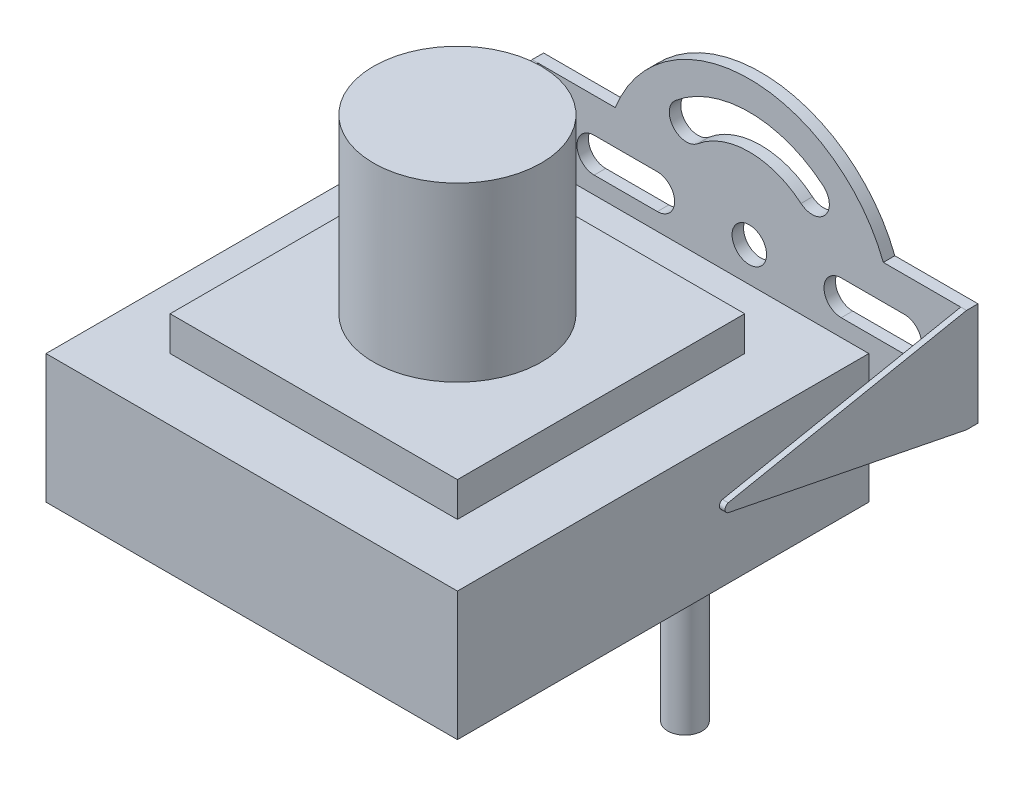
ISO-10303-21;
HEADER;
FILE_DESCRIPTION(('STEP AP214'),'2;1');
FILE_NAME('part.step','',(''),(''),'','','');
FILE_SCHEMA(('AUTOMOTIVE_DESIGN { 1 0 10303 214 1 1 1 1 }'));
ENDSEC;
DATA;
#1=APPLICATION_CONTEXT('core data for automotive mechanical design processes');
#2=APPLICATION_PROTOCOL_DEFINITION('international standard','automotive_design',2000,#1);
#3=PRODUCT_CONTEXT('',#1,'mechanical');
#4=PRODUCT('Part','Part','',(#3));
#5=PRODUCT_RELATED_PRODUCT_CATEGORY('part','',(#4));
#6=PRODUCT_DEFINITION_FORMATION('','',#4);
#7=PRODUCT_DEFINITION_CONTEXT('part definition',#1,'design');
#8=PRODUCT_DEFINITION('design','',#6,#7);
#9=PRODUCT_DEFINITION_SHAPE('','',#8);
#10=(LENGTH_UNIT() NAMED_UNIT(*) SI_UNIT(.MILLI.,.METRE.));
#11=(NAMED_UNIT(*) PLANE_ANGLE_UNIT() SI_UNIT($,.RADIAN.));
#12=(NAMED_UNIT(*) SI_UNIT($,.STERADIAN.) SOLID_ANGLE_UNIT());
#13=UNCERTAINTY_MEASURE_WITH_UNIT(LENGTH_MEASURE(1.E-05),#10,'distance_accuracy_value','');
#14=(GEOMETRIC_REPRESENTATION_CONTEXT(3) GLOBAL_UNCERTAINTY_ASSIGNED_CONTEXT((#13)) GLOBAL_UNIT_ASSIGNED_CONTEXT((#10,
#11,#12)) REPRESENTATION_CONTEXT('',''));
#15=CARTESIAN_POINT('',(0.,0.,0.));
#16=DIRECTION('',(0.,0.,1.));
#17=DIRECTION('',(1.,0.,0.));
#18=AXIS2_PLACEMENT_3D('',#15,#16,#17);
#19=CARTESIAN_POINT('',(0.,6.7,-26.4));
#20=DIRECTION('',(0.,0.,-1.));
#21=DIRECTION('',(-1.,0.,0.));
#22=AXIS2_PLACEMENT_3D('',#19,#20,#21);
#23=PLANE('',#22);
#24=DIRECTION('',(-1.,0.,0.));
#25=VECTOR('',#24,1.);
#26=CARTESIAN_POINT('',(-18.4,2.2,-26.4));
#27=LINE('',#26,#25);
#28=CARTESIAN_POINT('',(-11.6619037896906,2.2,-26.4));
#29=VERTEX_POINT('',#28);
#30=CARTESIAN_POINT('',(-18.9,2.2,-26.4));
#31=VERTEX_POINT('',#30);
#32=EDGE_CURVE('E467',#29,#31,#27,.T.);
#33=ORIENTED_EDGE('',*,*,#32,.T.);
#34=DIRECTION('',(0.,-1.,0.));
#35=VECTOR('',#34,1.);
#36=CARTESIAN_POINT('',(-18.9,11.2,-26.4));
#37=LINE('',#36,#35);
#38=CARTESIAN_POINT('',(-18.9,11.2,-26.4));
#39=VERTEX_POINT('',#38);
#40=EDGE_CURVE('E302',#39,#31,#37,.T.);
#41=ORIENTED_EDGE('',*,*,#40,.F.);
#42=DIRECTION('',(1.,0.,0.));
#43=VECTOR('',#42,1.);
#44=CARTESIAN_POINT('',(-18.4,11.2,-26.4));
#45=LINE('',#44,#43);
#46=CARTESIAN_POINT('',(-11.6619037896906,11.2,-26.4));
#47=VERTEX_POINT('',#46);
#48=EDGE_CURVE('E456',#39,#47,#45,.T.);
#49=ORIENTED_EDGE('',*,*,#48,.T.);
#50=CARTESIAN_POINT('',(0.,6.7,-26.4));
#51=DIRECTION('',(0.,0.,-1.));
#52=DIRECTION('',(-1.,0.,0.));
#53=AXIS2_PLACEMENT_3D('',#50,#51,#52);
#54=CIRCLE('',#53,12.5);
#55=CARTESIAN_POINT('',(11.6619037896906,11.2,-26.4));
#56=VERTEX_POINT('',#55);
#57=EDGE_CURVE('E458',#47,#56,#54,.T.);
#58=ORIENTED_EDGE('',*,*,#57,.T.);
#59=DIRECTION('',(1.,0.,0.));
#60=VECTOR('',#59,1.);
#61=CARTESIAN_POINT('',(18.4,11.2,-26.4));
#62=LINE('',#61,#60);
#63=CARTESIAN_POINT('',(18.9,11.2,-26.4));
#64=VERTEX_POINT('',#63);
#65=EDGE_CURVE('E461',#56,#64,#62,.T.);
#66=ORIENTED_EDGE('',*,*,#65,.T.);
#67=DIRECTION('',(0.,-1.,0.));
#68=VECTOR('',#67,1.);
#69=CARTESIAN_POINT('',(18.9,11.2,-26.4));
#70=LINE('',#69,#68);
#71=CARTESIAN_POINT('',(18.9,2.2,-26.4));
#72=VERTEX_POINT('',#71);
#73=EDGE_CURVE('E271',#64,#72,#70,.T.);
#74=ORIENTED_EDGE('',*,*,#73,.T.);
#75=DIRECTION('',(-1.,0.,0.));
#76=VECTOR('',#75,1.);
#77=CARTESIAN_POINT('',(18.4,2.20000000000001,-26.4));
#78=LINE('',#77,#76);
#79=CARTESIAN_POINT('',(11.6619037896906,2.2,-26.4));
#80=VERTEX_POINT('',#79);
#81=EDGE_CURVE('E463',#72,#80,#78,.T.);
#82=ORIENTED_EDGE('',*,*,#81,.T.);
#83=CARTESIAN_POINT('',(0.,6.7,-26.4));
#84=DIRECTION('',(0.,0.,-1.));
#85=DIRECTION('',(-1.,0.,0.));
#86=AXIS2_PLACEMENT_3D('',#83,#84,#85);
#87=CIRCLE('',#86,12.5);
#88=EDGE_CURVE('E465',#80,#29,#87,.T.);
#89=ORIENTED_EDGE('',*,*,#88,.T.);
#90=EDGE_LOOP('',(#33,#41,#49,#58,#66,#74,#82,#89));
#91=FACE_BOUND('',#90,.T.);
#92=CARTESIAN_POINT('',(0.,6.7,-26.4));
#93=DIRECTION('',(0.,0.,-1.));
#94=DIRECTION('',(-1.,0.,0.));
#95=AXIS2_PLACEMENT_3D('',#92,#93,#94);
#96=CIRCLE('',#95,1.5);
#97=CARTESIAN_POINT('',(-1.5,6.7,-26.4));
#98=VERTEX_POINT('',#97);
#99=EDGE_CURVE('E450',#98,#98,#96,.T.);
#100=ORIENTED_EDGE('',*,*,#99,.F.);
#101=EDGE_LOOP('',(#100));
#102=FACE_BOUND('',#101,.T.);
#103=CARTESIAN_POINT('',(0.,6.7,-26.4));
#104=DIRECTION('',(0.,0.,-1.));
#105=DIRECTION('',(-1.,0.,0.));
#106=AXIS2_PLACEMENT_3D('',#103,#104,#105);
#107=CIRCLE('',#106,10.);
#108=CARTESIAN_POINT('',(-6.42787609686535,14.3604444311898,-26.4));
#109=VERTEX_POINT('',#108);
#110=CARTESIAN_POINT('',(6.42787609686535,14.3604444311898,-26.4));
#111=VERTEX_POINT('',#110);
#112=EDGE_CURVE('E421',#109,#111,#107,.T.);
#113=ORIENTED_EDGE('',*,*,#112,.F.);
#114=CARTESIAN_POINT('',(-5.46369468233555,13.2113777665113,-26.4));
#115=DIRECTION('',(0.,0.,-1.));
#116=DIRECTION('',(-1.,0.,0.));
#117=AXIS2_PLACEMENT_3D('',#114,#115,#116);
#118=CIRCLE('',#117,1.5);
#119=CARTESIAN_POINT('',(-4.49951326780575,12.0623111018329,-26.4));
#120=VERTEX_POINT('',#119);
#121=EDGE_CURVE('E419',#120,#109,#118,.T.);
#122=ORIENTED_EDGE('',*,*,#121,.F.);
#123=CARTESIAN_POINT('',(0.,6.7,-26.4));
#124=DIRECTION('',(0.,0.,1.));
#125=DIRECTION('',(-1.,0.,0.));
#126=AXIS2_PLACEMENT_3D('',#123,#124,#125);
#127=CIRCLE('',#126,7.);
#128=CARTESIAN_POINT('',(4.49951326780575,12.0623111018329,-26.4));
#129=VERTEX_POINT('',#128);
#130=EDGE_CURVE('E427',#129,#120,#127,.T.);
#131=ORIENTED_EDGE('',*,*,#130,.F.);
#132=CARTESIAN_POINT('',(5.46369468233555,13.2113777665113,-26.4));
#133=DIRECTION('',(0.,0.,-1.));
#134=DIRECTION('',(-1.,0.,0.));
#135=AXIS2_PLACEMENT_3D('',#132,#133,#134);
#136=CIRCLE('',#135,1.5);
#137=EDGE_CURVE('E424',#111,#129,#136,.T.);
#138=ORIENTED_EDGE('',*,*,#137,.F.);
#139=EDGE_LOOP('',(#113,#122,#131,#138));
#140=FACE_BOUND('',#139,.T.);
#141=CARTESIAN_POINT('',(0.,6.7,-26.4));
#142=DIRECTION('',(0.,0.,1.));
#143=DIRECTION('',(1.,0.,0.));
#144=AXIS2_PLACEMENT_3D('',#141,#142,#143);
#145=CIRCLE('',#144,7.00000000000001);
#146=CARTESIAN_POINT('',(-4.49951326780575,1.33768889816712,-26.4));
#147=VERTEX_POINT('',#146);
#148=CARTESIAN_POINT('',(4.49951326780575,1.33768889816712,-26.4));
#149=VERTEX_POINT('',#148);
#150=EDGE_CURVE('E390',#147,#149,#145,.T.);
#151=ORIENTED_EDGE('',*,*,#150,.F.);
#152=CARTESIAN_POINT('',(-5.46369468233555,0.188622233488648,-26.4));
#153=DIRECTION('',(0.,0.,-1.));
#154=DIRECTION('',(1.,0.,0.));
#155=AXIS2_PLACEMENT_3D('',#152,#153,#154);
#156=CIRCLE('',#155,1.5);
#157=CARTESIAN_POINT('',(-6.42787609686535,-0.960444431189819,-26.4));
#158=VERTEX_POINT('',#157);
#159=EDGE_CURVE('E388',#158,#147,#156,.T.);
#160=ORIENTED_EDGE('',*,*,#159,.F.);
#161=CARTESIAN_POINT('',(0.,6.7,-26.4));
#162=DIRECTION('',(0.,0.,-1.));
#163=DIRECTION('',(1.,0.,0.));
#164=AXIS2_PLACEMENT_3D('',#161,#162,#163);
#165=CIRCLE('',#164,10.);
#166=CARTESIAN_POINT('',(6.42787609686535,-0.960444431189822,-26.4));
#167=VERTEX_POINT('',#166);
#168=EDGE_CURVE('E396',#167,#158,#165,.T.);
#169=ORIENTED_EDGE('',*,*,#168,.F.);
#170=CARTESIAN_POINT('',(5.46369468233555,0.18862223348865,-26.4));
#171=DIRECTION('',(0.,0.,-1.));
#172=DIRECTION('',(1.,0.,0.));
#173=AXIS2_PLACEMENT_3D('',#170,#171,#172);
#174=CIRCLE('',#173,1.5);
#175=EDGE_CURVE('E393',#149,#167,#174,.T.);
#176=ORIENTED_EDGE('',*,*,#175,.F.);
#177=EDGE_LOOP('',(#151,#160,#169,#176));
#178=FACE_BOUND('',#177,.T.);
#179=DIRECTION('',(-1.,0.,0.));
#180=VECTOR('',#179,1.);
#181=CARTESIAN_POINT('',(-8.,5.20000000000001,-26.4));
#182=LINE('',#181,#180);
#183=CARTESIAN_POINT('',(-8.,5.20000000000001,-26.4));
#184=VERTEX_POINT('',#183);
#185=CARTESIAN_POINT('',(-13.5,5.20000000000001,-26.4));
#186=VERTEX_POINT('',#185);
#187=EDGE_CURVE('E359',#184,#186,#182,.T.);
#188=ORIENTED_EDGE('',*,*,#187,.F.);
#189=CARTESIAN_POINT('',(-8.,6.70000000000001,-26.4));
#190=DIRECTION('',(0.,0.,-1.));
#191=DIRECTION('',(-1.,0.,0.));
#192=AXIS2_PLACEMENT_3D('',#189,#190,#191);
#193=CIRCLE('',#192,1.5);
#194=CARTESIAN_POINT('',(-8.,8.2,-26.4));
#195=VERTEX_POINT('',#194);
#196=EDGE_CURVE('E357',#195,#184,#193,.T.);
#197=ORIENTED_EDGE('',*,*,#196,.F.);
#198=DIRECTION('',(1.,0.,0.));
#199=VECTOR('',#198,1.);
#200=CARTESIAN_POINT('',(-8.,8.2,-26.4));
#201=LINE('',#200,#199);
#202=CARTESIAN_POINT('',(-13.5,8.2,-26.4));
#203=VERTEX_POINT('',#202);
#204=EDGE_CURVE('E365',#203,#195,#201,.T.);
#205=ORIENTED_EDGE('',*,*,#204,.F.);
#206=CARTESIAN_POINT('',(-13.5,6.70000000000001,-26.4));
#207=DIRECTION('',(0.,0.,-1.));
#208=DIRECTION('',(-1.,0.,0.));
#209=AXIS2_PLACEMENT_3D('',#206,#207,#208);
#210=CIRCLE('',#209,1.5);
#211=EDGE_CURVE('E362',#186,#203,#210,.T.);
#212=ORIENTED_EDGE('',*,*,#211,.F.);
#213=EDGE_LOOP('',(#188,#197,#205,#212));
#214=FACE_BOUND('',#213,.T.);
#215=DIRECTION('',(1.,0.,0.));
#216=VECTOR('',#215,1.);
#217=CARTESIAN_POINT('',(8.,8.2,-26.4));
#218=LINE('',#217,#216);
#219=CARTESIAN_POINT('',(8.,8.2,-26.4));
#220=VERTEX_POINT('',#219);
#221=CARTESIAN_POINT('',(13.5,8.2,-26.4));
#222=VERTEX_POINT('',#221);
#223=EDGE_CURVE('E333',#220,#222,#218,.T.);
#224=ORIENTED_EDGE('',*,*,#223,.F.);
#225=CARTESIAN_POINT('',(8.,6.7,-26.4));
#226=DIRECTION('',(0.,0.,-1.));
#227=DIRECTION('',(1.,0.,0.));
#228=AXIS2_PLACEMENT_3D('',#225,#226,#227);
#229=CIRCLE('',#228,1.5);
#230=CARTESIAN_POINT('',(8.,5.20000000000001,-26.4));
#231=VERTEX_POINT('',#230);
#232=EDGE_CURVE('E331',#231,#220,#229,.T.);
#233=ORIENTED_EDGE('',*,*,#232,.F.);
#234=DIRECTION('',(-1.,0.,0.));
#235=VECTOR('',#234,1.);
#236=CARTESIAN_POINT('',(8.,5.20000000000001,-26.4));
#237=LINE('',#236,#235);
#238=CARTESIAN_POINT('',(13.5,5.20000000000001,-26.4));
#239=VERTEX_POINT('',#238);
#240=EDGE_CURVE('E338',#239,#231,#237,.T.);
#241=ORIENTED_EDGE('',*,*,#240,.F.);
#242=CARTESIAN_POINT('',(13.5,6.70000000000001,-26.4));
#243=DIRECTION('',(0.,0.,-1.));
#244=DIRECTION('',(1.,0.,0.));
#245=AXIS2_PLACEMENT_3D('',#242,#243,#244);
#246=CIRCLE('',#245,1.5);
#247=EDGE_CURVE('E336',#222,#239,#246,.T.);
#248=ORIENTED_EDGE('',*,*,#247,.F.);
#249=EDGE_LOOP('',(#224,#233,#241,#248));
#250=FACE_BOUND('',#249,.T.);
#251=ADVANCED_FACE('F47',(#91,#102,#140,#178,#214,#250),#23,.T.);
#252=CARTESIAN_POINT('',(0.,6.7,-25.4));
#253=DIRECTION('',(0.,0.,-1.));
#254=DIRECTION('',(-1.,0.,0.));
#255=AXIS2_PLACEMENT_3D('',#252,#253,#254);
#256=PLANE('',#255);
#257=CARTESIAN_POINT('',(-8.,6.70000000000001,-25.4));
#258=DIRECTION('',(0.,0.,-1.));
#259=DIRECTION('',(-1.,0.,0.));
#260=AXIS2_PLACEMENT_3D('',#257,#258,#259);
#261=CIRCLE('',#260,1.5);
#262=CARTESIAN_POINT('',(-8.,8.2,-25.4));
#263=VERTEX_POINT('',#262);
#264=CARTESIAN_POINT('',(-8.,5.20000000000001,-25.4));
#265=VERTEX_POINT('',#264);
#266=EDGE_CURVE('E356',#263,#265,#261,.T.);
#267=ORIENTED_EDGE('',*,*,#266,.T.);
#268=DIRECTION('',(-1.,0.,0.));
#269=VECTOR('',#268,1.);
#270=CARTESIAN_POINT('',(-8.,5.20000000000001,-25.4));
#271=LINE('',#270,#269);
#272=CARTESIAN_POINT('',(-13.5,5.20000000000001,-25.4));
#273=VERTEX_POINT('',#272);
#274=EDGE_CURVE('E370',#265,#273,#271,.T.);
#275=ORIENTED_EDGE('',*,*,#274,.T.);
#276=CARTESIAN_POINT('',(-13.5,6.70000000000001,-25.4));
#277=DIRECTION('',(0.,0.,-1.));
#278=DIRECTION('',(-1.,0.,0.));
#279=AXIS2_PLACEMENT_3D('',#276,#277,#278);
#280=CIRCLE('',#279,1.5);
#281=CARTESIAN_POINT('',(-13.5,8.2,-25.4));
#282=VERTEX_POINT('',#281);
#283=EDGE_CURVE('E373',#273,#282,#280,.T.);
#284=ORIENTED_EDGE('',*,*,#283,.T.);
#285=DIRECTION('',(1.,0.,0.));
#286=VECTOR('',#285,1.);
#287=CARTESIAN_POINT('',(-8.,8.2,-25.4));
#288=LINE('',#287,#286);
#289=EDGE_CURVE('E360',#282,#263,#288,.T.);
#290=ORIENTED_EDGE('',*,*,#289,.T.);
#291=EDGE_LOOP('',(#267,#275,#284,#290));
#292=FACE_BOUND('',#291,.T.);
#293=CARTESIAN_POINT('',(-5.46369468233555,13.2113777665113,-25.4));
#294=DIRECTION('',(0.,0.,-1.));
#295=DIRECTION('',(-1.,0.,0.));
#296=AXIS2_PLACEMENT_3D('',#293,#294,#295);
#297=CIRCLE('',#296,1.5);
#298=CARTESIAN_POINT('',(-4.49951326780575,12.0623111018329,-25.4));
#299=VERTEX_POINT('',#298);
#300=CARTESIAN_POINT('',(-6.42787609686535,14.3604444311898,-25.4));
#301=VERTEX_POINT('',#300);
#302=EDGE_CURVE('E418',#299,#301,#297,.T.);
#303=ORIENTED_EDGE('',*,*,#302,.T.);
#304=CARTESIAN_POINT('',(0.,6.7,-25.4));
#305=DIRECTION('',(0.,0.,-1.));
#306=DIRECTION('',(-1.,0.,0.));
#307=AXIS2_PLACEMENT_3D('',#304,#305,#306);
#308=CIRCLE('',#307,10.);
#309=CARTESIAN_POINT('',(6.42787609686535,14.3604444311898,-25.4));
#310=VERTEX_POINT('',#309);
#311=EDGE_CURVE('E432',#301,#310,#308,.T.);
#312=ORIENTED_EDGE('',*,*,#311,.T.);
#313=CARTESIAN_POINT('',(5.46369468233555,13.2113777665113,-25.4));
#314=DIRECTION('',(0.,0.,-1.));
#315=DIRECTION('',(-1.,0.,0.));
#316=AXIS2_PLACEMENT_3D('',#313,#314,#315);
#317=CIRCLE('',#316,1.5);
#318=CARTESIAN_POINT('',(4.49951326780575,12.0623111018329,-25.4));
#319=VERTEX_POINT('',#318);
#320=EDGE_CURVE('E435',#310,#319,#317,.T.);
#321=ORIENTED_EDGE('',*,*,#320,.T.);
#322=CARTESIAN_POINT('',(0.,6.7,-25.4));
#323=DIRECTION('',(0.,0.,1.));
#324=DIRECTION('',(-1.,0.,0.));
#325=AXIS2_PLACEMENT_3D('',#322,#323,#324);
#326=CIRCLE('',#325,7.);
#327=EDGE_CURVE('E422',#319,#299,#326,.T.);
#328=ORIENTED_EDGE('',*,*,#327,.T.);
#329=EDGE_LOOP('',(#303,#312,#321,#328));
#330=FACE_BOUND('',#329,.T.);
#331=DIRECTION('',(0.,1.,0.));
#332=VECTOR('',#331,1.);
#333=CARTESIAN_POINT('',(-18.4,11.2,-25.4));
#334=LINE('',#333,#332);
#335=CARTESIAN_POINT('',(-18.4,2.2,-25.4));
#336=VERTEX_POINT('',#335);
#337=CARTESIAN_POINT('',(-18.4,11.2,-25.4));
#338=VERTEX_POINT('',#337);
#339=EDGE_CURVE('E453',#336,#338,#334,.T.);
#340=ORIENTED_EDGE('',*,*,#339,.F.);
#341=DIRECTION('',(-1.,0.,0.));
#342=VECTOR('',#341,1.);
#343=CARTESIAN_POINT('',(-18.4,2.2,-25.4));
#344=LINE('',#343,#342);
#345=CARTESIAN_POINT('',(-11.6619037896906,2.2,-25.4));
#346=VERTEX_POINT('',#345);
#347=EDGE_CURVE('E459',#346,#336,#344,.T.);
#348=ORIENTED_EDGE('',*,*,#347,.F.);
#349=CARTESIAN_POINT('',(0.,6.7,-25.4));
#350=DIRECTION('',(0.,0.,-1.));
#351=DIRECTION('',(-1.,0.,0.));
#352=AXIS2_PLACEMENT_3D('',#349,#350,#351);
#353=CIRCLE('',#352,12.5);
#354=CARTESIAN_POINT('',(11.6619037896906,2.2,-25.4));
#355=VERTEX_POINT('',#354);
#356=EDGE_CURVE('E482',#355,#346,#353,.T.);
#357=ORIENTED_EDGE('',*,*,#356,.F.);
#358=DIRECTION('',(-1.,0.,0.));
#359=VECTOR('',#358,1.);
#360=CARTESIAN_POINT('',(18.4,2.20000000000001,-25.4));
#361=LINE('',#360,#359);
#362=CARTESIAN_POINT('',(18.4,2.2,-25.4));
#363=VERTEX_POINT('',#362);
#364=EDGE_CURVE('E480',#363,#355,#361,.T.);
#365=ORIENTED_EDGE('',*,*,#364,.F.);
#366=DIRECTION('',(0.,-1.,0.));
#367=VECTOR('',#366,1.);
#368=CARTESIAN_POINT('',(18.4,11.2,-25.4));
#369=LINE('',#368,#367);
#370=CARTESIAN_POINT('',(18.4,11.2,-25.4));
#371=VERTEX_POINT('',#370);
#372=EDGE_CURVE('E477',#371,#363,#369,.T.);
#373=ORIENTED_EDGE('',*,*,#372,.F.);
#374=DIRECTION('',(1.,0.,0.));
#375=VECTOR('',#374,1.);
#376=CARTESIAN_POINT('',(18.4,11.2,-25.4));
#377=LINE('',#376,#375);
#378=CARTESIAN_POINT('',(11.6619037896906,11.2,-25.4));
#379=VERTEX_POINT('',#378);
#380=EDGE_CURVE('E254',#379,#371,#377,.T.);
#381=ORIENTED_EDGE('',*,*,#380,.F.);
#382=CARTESIAN_POINT('',(0.,6.7,-25.4));
#383=DIRECTION('',(0.,0.,-1.));
#384=DIRECTION('',(-1.,0.,0.));
#385=AXIS2_PLACEMENT_3D('',#382,#383,#384);
#386=CIRCLE('',#385,12.5);
#387=CARTESIAN_POINT('',(-11.6619037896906,11.2,-25.4));
#388=VERTEX_POINT('',#387);
#389=EDGE_CURVE('E474',#388,#379,#386,.T.);
#390=ORIENTED_EDGE('',*,*,#389,.F.);
#391=DIRECTION('',(1.,0.,0.));
#392=VECTOR('',#391,1.);
#393=CARTESIAN_POINT('',(-18.4,11.2,-25.4));
#394=LINE('',#393,#392);
#395=EDGE_CURVE('E472',#338,#388,#394,.T.);
#396=ORIENTED_EDGE('',*,*,#395,.F.);
#397=EDGE_LOOP('',(#340,#348,#357,#365,#373,#381,#390,#396));
#398=FACE_BOUND('',#397,.T.);
#399=CARTESIAN_POINT('',(0.,6.7,-25.4));
#400=DIRECTION('',(0.,0.,-1.));
#401=DIRECTION('',(-1.,0.,0.));
#402=AXIS2_PLACEMENT_3D('',#399,#400,#401);
#403=CIRCLE('',#402,1.5);
#404=CARTESIAN_POINT('',(-1.5,6.7,-25.4));
#405=VERTEX_POINT('',#404);
#406=EDGE_CURVE('E449',#405,#405,#403,.T.);
#407=ORIENTED_EDGE('',*,*,#406,.T.);
#408=EDGE_LOOP('',(#407));
#409=FACE_BOUND('',#408,.T.);
#410=CARTESIAN_POINT('',(-5.46369468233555,0.188622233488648,-25.4));
#411=DIRECTION('',(0.,0.,-1.));
#412=DIRECTION('',(1.,0.,0.));
#413=AXIS2_PLACEMENT_3D('',#410,#411,#412);
#414=CIRCLE('',#413,1.5);
#415=CARTESIAN_POINT('',(-6.42787609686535,-0.960444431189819,-25.4));
#416=VERTEX_POINT('',#415);
#417=CARTESIAN_POINT('',(-4.49951326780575,1.33768889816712,-25.4));
#418=VERTEX_POINT('',#417);
#419=EDGE_CURVE('E387',#416,#418,#414,.T.);
#420=ORIENTED_EDGE('',*,*,#419,.T.);
#421=CARTESIAN_POINT('',(0.,6.7,-25.4));
#422=DIRECTION('',(0.,0.,1.));
#423=DIRECTION('',(1.,0.,0.));
#424=AXIS2_PLACEMENT_3D('',#421,#422,#423);
#425=CIRCLE('',#424,7.00000000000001);
#426=CARTESIAN_POINT('',(4.49951326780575,1.33768889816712,-25.4));
#427=VERTEX_POINT('',#426);
#428=EDGE_CURVE('E401',#418,#427,#425,.T.);
#429=ORIENTED_EDGE('',*,*,#428,.T.);
#430=CARTESIAN_POINT('',(5.46369468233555,0.18862223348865,-25.4));
#431=DIRECTION('',(0.,0.,-1.));
#432=DIRECTION('',(1.,0.,0.));
#433=AXIS2_PLACEMENT_3D('',#430,#431,#432);
#434=CIRCLE('',#433,1.5);
#435=CARTESIAN_POINT('',(6.42787609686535,-0.960444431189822,-25.4));
#436=VERTEX_POINT('',#435);
#437=EDGE_CURVE('E404',#427,#436,#434,.T.);
#438=ORIENTED_EDGE('',*,*,#437,.T.);
#439=CARTESIAN_POINT('',(0.,6.7,-25.4));
#440=DIRECTION('',(0.,0.,-1.));
#441=DIRECTION('',(1.,0.,0.));
#442=AXIS2_PLACEMENT_3D('',#439,#440,#441);
#443=CIRCLE('',#442,10.);
#444=EDGE_CURVE('E391',#436,#416,#443,.T.);
#445=ORIENTED_EDGE('',*,*,#444,.T.);
#446=EDGE_LOOP('',(#420,#429,#438,#445));
#447=FACE_BOUND('',#446,.T.);
#448=CARTESIAN_POINT('',(8.,6.7,-25.4));
#449=DIRECTION('',(0.,0.,-1.));
#450=DIRECTION('',(1.,0.,0.));
#451=AXIS2_PLACEMENT_3D('',#448,#449,#450);
#452=CIRCLE('',#451,1.5);
#453=CARTESIAN_POINT('',(8.,5.20000000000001,-25.4));
#454=VERTEX_POINT('',#453);
#455=CARTESIAN_POINT('',(8.,8.2,-25.4));
#456=VERTEX_POINT('',#455);
#457=EDGE_CURVE('E70',#454,#456,#452,.T.);
#458=ORIENTED_EDGE('',*,*,#457,.T.);
#459=DIRECTION('',(1.,0.,0.));
#460=VECTOR('',#459,1.);
#461=CARTESIAN_POINT('',(8.,8.2,-25.4));
#462=LINE('',#461,#460);
#463=CARTESIAN_POINT('',(13.5,8.2,-25.4));
#464=VERTEX_POINT('',#463);
#465=EDGE_CURVE('E342',#456,#464,#462,.T.);
#466=ORIENTED_EDGE('',*,*,#465,.T.);
#467=CARTESIAN_POINT('',(13.5,6.70000000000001,-25.4));
#468=DIRECTION('',(0.,0.,-1.));
#469=DIRECTION('',(1.,0.,0.));
#470=AXIS2_PLACEMENT_3D('',#467,#468,#469);
#471=CIRCLE('',#470,1.5);
#472=CARTESIAN_POINT('',(13.5,5.20000000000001,-25.4));
#473=VERTEX_POINT('',#472);
#474=EDGE_CURVE('E345',#464,#473,#471,.T.);
#475=ORIENTED_EDGE('',*,*,#474,.T.);
#476=DIRECTION('',(-1.,0.,0.));
#477=VECTOR('',#476,1.);
#478=CARTESIAN_POINT('',(8.,5.20000000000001,-25.4));
#479=LINE('',#478,#477);
#480=EDGE_CURVE('E334',#473,#454,#479,.T.);
#481=ORIENTED_EDGE('',*,*,#480,.T.);
#482=EDGE_LOOP('',(#458,#466,#475,#481));
#483=FACE_BOUND('',#482,.T.);
#484=ADVANCED_FACE('F495',(#292,#330,#398,#409,#447,#483),#256,.F.);
#485=CARTESIAN_POINT('',(-18.4,11.2,-26.4));
#486=DIRECTION('',(0.,-1.,0.));
#487=DIRECTION('',(0.,0.,-1.));
#488=AXIS2_PLACEMENT_3D('',#485,#486,#487);
#489=PLANE('',#488);
#490=ORIENTED_EDGE('',*,*,#395,.T.);
#491=DIRECTION('',(0.,0.,1.));
#492=VECTOR('',#491,1.);
#493=CARTESIAN_POINT('',(-11.6619037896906,11.2,-26.4));
#494=LINE('',#493,#492);
#495=EDGE_CURVE('E12',#47,#388,#494,.T.);
#496=ORIENTED_EDGE('',*,*,#495,.F.);
#497=ORIENTED_EDGE('',*,*,#48,.F.);
#498=DIRECTION('',(0.,0.,-1.));
#499=VECTOR('',#498,1.);
#500=CARTESIAN_POINT('',(-18.9,11.2,-25.4));
#501=LINE('',#500,#499);
#502=CARTESIAN_POINT('',(-18.9,11.2,-25.4));
#503=VERTEX_POINT('',#502);
#504=EDGE_CURVE('E299',#503,#39,#501,.T.);
#505=ORIENTED_EDGE('',*,*,#504,.F.);
#506=DIRECTION('',(1.,0.,0.));
#507=VECTOR('',#506,1.);
#508=CARTESIAN_POINT('',(-18.9,11.2,-25.4));
#509=LINE('',#508,#507);
#510=EDGE_CURVE('E314',#503,#338,#509,.T.);
#511=ORIENTED_EDGE('',*,*,#510,.T.);
#512=EDGE_LOOP('',(#490,#496,#497,#505,#511));
#513=FACE_BOUND('',#512,.T.);
#514=ADVANCED_FACE('F49',(#513),#489,.F.);
#515=CARTESIAN_POINT('',(0.,6.7,-26.4));
#516=DIRECTION('',(0.,0.,1.));
#517=DIRECTION('',(1.,0.,0.));
#518=AXIS2_PLACEMENT_3D('',#515,#516,#517);
#519=CYLINDRICAL_SURFACE('',#518,12.5);
#520=ORIENTED_EDGE('',*,*,#389,.T.);
#521=DIRECTION('',(0.,0.,1.));
#522=VECTOR('',#521,1.);
#523=CARTESIAN_POINT('',(11.6619037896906,11.2,-26.4));
#524=LINE('',#523,#522);
#525=EDGE_CURVE('E55',#56,#379,#524,.T.);
#526=ORIENTED_EDGE('',*,*,#525,.F.);
#527=ORIENTED_EDGE('',*,*,#57,.F.);
#528=ORIENTED_EDGE('',*,*,#495,.T.);
#529=EDGE_LOOP('',(#520,#526,#527,#528));
#530=FACE_BOUND('',#529,.T.);
#531=ADVANCED_FACE('F514',(#530),#519,.T.);
#532=CARTESIAN_POINT('',(18.4,11.2,-26.4));
#533=DIRECTION('',(0.,-1.,0.));
#534=DIRECTION('',(1.,0.,0.));
#535=AXIS2_PLACEMENT_3D('',#532,#533,#534);
#536=PLANE('',#535);
#537=ORIENTED_EDGE('',*,*,#380,.T.);
#538=DIRECTION('',(-1.,0.,0.));
#539=VECTOR('',#538,1.);
#540=CARTESIAN_POINT('',(18.9,11.2,-25.4));
#541=LINE('',#540,#539);
#542=CARTESIAN_POINT('',(18.9,11.2,-25.4));
#543=VERTEX_POINT('',#542);
#544=EDGE_CURVE('E246',#543,#371,#541,.T.);
#545=ORIENTED_EDGE('',*,*,#544,.F.);
#546=DIRECTION('',(0.,0.,-1.));
#547=VECTOR('',#546,1.);
#548=CARTESIAN_POINT('',(18.9,11.2,-25.4));
#549=LINE('',#548,#547);
#550=EDGE_CURVE('E250',#543,#64,#549,.T.);
#551=ORIENTED_EDGE('',*,*,#550,.T.);
#552=ORIENTED_EDGE('',*,*,#65,.F.);
#553=ORIENTED_EDGE('',*,*,#525,.T.);
#554=EDGE_LOOP('',(#537,#545,#551,#552,#553));
#555=FACE_BOUND('',#554,.T.);
#556=ADVANCED_FACE('F248',(#555),#536,.F.);
#557=CARTESIAN_POINT('',(18.4,2.20000000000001,-26.4));
#558=DIRECTION('',(0.,1.,0.));
#559=DIRECTION('',(-1.,0.,0.));
#560=AXIS2_PLACEMENT_3D('',#557,#558,#559);
#561=PLANE('',#560);
#562=ORIENTED_EDGE('',*,*,#364,.T.);
#563=DIRECTION('',(0.,0.,1.));
#564=VECTOR('',#563,1.);
#565=CARTESIAN_POINT('',(11.6619037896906,2.2,-26.4));
#566=LINE('',#565,#564);
#567=EDGE_CURVE('E487',#80,#355,#566,.T.);
#568=ORIENTED_EDGE('',*,*,#567,.F.);
#569=ORIENTED_EDGE('',*,*,#81,.F.);
#570=DIRECTION('',(0.,0.,1.));
#571=VECTOR('',#570,1.);
#572=CARTESIAN_POINT('',(18.9,2.2,-26.4));
#573=LINE('',#572,#571);
#574=CARTESIAN_POINT('',(18.9,2.2,-25.4));
#575=VERTEX_POINT('',#574);
#576=EDGE_CURVE('E282',#72,#575,#573,.T.);
#577=ORIENTED_EDGE('',*,*,#576,.T.);
#578=DIRECTION('',(-1.,0.,0.));
#579=VECTOR('',#578,1.);
#580=CARTESIAN_POINT('',(18.9,2.2,-25.4));
#581=LINE('',#580,#579);
#582=EDGE_CURVE('E286',#575,#363,#581,.T.);
#583=ORIENTED_EDGE('',*,*,#582,.T.);
#584=EDGE_LOOP('',(#562,#568,#569,#577,#583));
#585=FACE_BOUND('',#584,.T.);
#586=ADVANCED_FACE('F502',(#585),#561,.F.);
#587=CARTESIAN_POINT('',(0.,6.7,-26.4));
#588=DIRECTION('',(0.,0.,1.));
#589=DIRECTION('',(1.,0.,0.));
#590=AXIS2_PLACEMENT_3D('',#587,#588,#589);
#591=CYLINDRICAL_SURFACE('',#590,12.5);
#592=ORIENTED_EDGE('',*,*,#356,.T.);
#593=DIRECTION('',(0.,0.,1.));
#594=VECTOR('',#593,1.);
#595=CARTESIAN_POINT('',(-11.6619037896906,2.2,-26.4));
#596=LINE('',#595,#594);
#597=EDGE_CURVE('E469',#29,#346,#596,.T.);
#598=ORIENTED_EDGE('',*,*,#597,.F.);
#599=ORIENTED_EDGE('',*,*,#88,.F.);
#600=ORIENTED_EDGE('',*,*,#567,.T.);
#601=EDGE_LOOP('',(#592,#598,#599,#600));
#602=FACE_BOUND('',#601,.T.);
#603=ADVANCED_FACE('F542',(#602),#591,.T.);
#604=CARTESIAN_POINT('',(-18.4,2.2,-26.4));
#605=DIRECTION('',(0.,1.,0.));
#606=DIRECTION('',(0.,0.,1.));
#607=AXIS2_PLACEMENT_3D('',#604,#605,#606);
#608=PLANE('',#607);
#609=ORIENTED_EDGE('',*,*,#347,.T.);
#610=DIRECTION('',(1.,0.,0.));
#611=VECTOR('',#610,1.);
#612=CARTESIAN_POINT('',(-18.9,2.2,-25.4));
#613=LINE('',#612,#611);
#614=CARTESIAN_POINT('',(-18.9,2.2,-25.4));
#615=VERTEX_POINT('',#614);
#616=EDGE_CURVE('E328',#615,#336,#613,.T.);
#617=ORIENTED_EDGE('',*,*,#616,.F.);
#618=DIRECTION('',(0.,0.,1.));
#619=VECTOR('',#618,1.);
#620=CARTESIAN_POINT('',(-18.9,2.2,-26.4));
#621=LINE('',#620,#619);
#622=EDGE_CURVE('E306',#31,#615,#621,.T.);
#623=ORIENTED_EDGE('',*,*,#622,.F.);
#624=ORIENTED_EDGE('',*,*,#32,.F.);
#625=ORIENTED_EDGE('',*,*,#597,.T.);
#626=EDGE_LOOP('',(#609,#617,#623,#624,#625));
#627=FACE_BOUND('',#626,.T.);
#628=ADVANCED_FACE('F538',(#627),#608,.F.);
#629=CARTESIAN_POINT('',(0.,6.7,-26.4));
#630=DIRECTION('',(0.,0.,1.));
#631=DIRECTION('',(1.,0.,0.));
#632=AXIS2_PLACEMENT_3D('',#629,#630,#631);
#633=CYLINDRICAL_SURFACE('',#632,1.5);
#634=ORIENTED_EDGE('',*,*,#99,.T.);
#635=EDGE_LOOP('',(#634));
#636=FACE_BOUND('',#635,.T.);
#637=ORIENTED_EDGE('',*,*,#406,.F.);
#638=EDGE_LOOP('',(#637));
#639=FACE_BOUND('',#638,.T.);
#640=ADVANCED_FACE('F563',(#636,#639),#633,.F.);
#641=CARTESIAN_POINT('',(-5.46369468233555,13.2113777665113,-26.4));
#642=DIRECTION('',(0.,0.,1.));
#643=DIRECTION('',(1.,0.,0.));
#644=AXIS2_PLACEMENT_3D('',#641,#642,#643);
#645=CYLINDRICAL_SURFACE('',#644,1.5);
#646=ORIENTED_EDGE('',*,*,#302,.F.);
#647=DIRECTION('',(0.,0.,1.));
#648=VECTOR('',#647,1.);
#649=CARTESIAN_POINT('',(-4.49951326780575,12.0623111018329,-26.4));
#650=LINE('',#649,#648);
#651=EDGE_CURVE('E429',#120,#299,#650,.T.);
#652=ORIENTED_EDGE('',*,*,#651,.F.);
#653=ORIENTED_EDGE('',*,*,#121,.T.);
#654=DIRECTION('',(0.,0.,1.));
#655=VECTOR('',#654,1.);
#656=CARTESIAN_POINT('',(-6.42787609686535,14.3604444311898,-26.4));
#657=LINE('',#656,#655);
#658=EDGE_CURVE('E446',#109,#301,#657,.T.);
#659=ORIENTED_EDGE('',*,*,#658,.T.);
#660=EDGE_LOOP('',(#646,#652,#653,#659));
#661=FACE_BOUND('',#660,.T.);
#662=ADVANCED_FACE('F692',(#661),#645,.F.);
#663=CARTESIAN_POINT('',(0.,6.7,-26.4));
#664=DIRECTION('',(0.,0.,1.));
#665=DIRECTION('',(1.,0.,0.));
#666=AXIS2_PLACEMENT_3D('',#663,#664,#665);
#667=CYLINDRICAL_SURFACE('',#666,10.);
#668=ORIENTED_EDGE('',*,*,#311,.F.);
#669=ORIENTED_EDGE('',*,*,#658,.F.);
#670=ORIENTED_EDGE('',*,*,#112,.T.);
#671=DIRECTION('',(0.,0.,1.));
#672=VECTOR('',#671,1.);
#673=CARTESIAN_POINT('',(6.42787609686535,14.3604444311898,-26.4));
#674=LINE('',#673,#672);
#675=EDGE_CURVE('E444',#111,#310,#674,.T.);
#676=ORIENTED_EDGE('',*,*,#675,.T.);
#677=EDGE_LOOP('',(#668,#669,#670,#676));
#678=FACE_BOUND('',#677,.T.);
#679=ADVANCED_FACE('F699',(#678),#667,.F.);
#680=CARTESIAN_POINT('',(5.46369468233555,13.2113777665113,-26.4));
#681=DIRECTION('',(0.,0.,1.));
#682=DIRECTION('',(1.,0.,0.));
#683=AXIS2_PLACEMENT_3D('',#680,#681,#682);
#684=CYLINDRICAL_SURFACE('',#683,1.5);
#685=ORIENTED_EDGE('',*,*,#320,.F.);
#686=ORIENTED_EDGE('',*,*,#675,.F.);
#687=ORIENTED_EDGE('',*,*,#137,.T.);
#688=DIRECTION('',(0.,0.,1.));
#689=VECTOR('',#688,1.);
#690=CARTESIAN_POINT('',(4.49951326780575,12.0623111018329,-26.4));
#691=LINE('',#690,#689);
#692=EDGE_CURVE('E442',#129,#319,#691,.T.);
#693=ORIENTED_EDGE('',*,*,#692,.T.);
#694=EDGE_LOOP('',(#685,#686,#687,#693));
#695=FACE_BOUND('',#694,.T.);
#696=ADVANCED_FACE('F706',(#695),#684,.F.);
#697=CARTESIAN_POINT('',(0.,6.7,-26.4));
#698=DIRECTION('',(0.,0.,1.));
#699=DIRECTION('',(1.,0.,0.));
#700=AXIS2_PLACEMENT_3D('',#697,#698,#699);
#701=CYLINDRICAL_SURFACE('',#700,7.);
#702=ORIENTED_EDGE('',*,*,#327,.F.);
#703=ORIENTED_EDGE('',*,*,#692,.F.);
#704=ORIENTED_EDGE('',*,*,#130,.T.);
#705=ORIENTED_EDGE('',*,*,#651,.T.);
#706=EDGE_LOOP('',(#702,#703,#704,#705));
#707=FACE_BOUND('',#706,.T.);
#708=ADVANCED_FACE('F714',(#707),#701,.T.);
#709=CARTESIAN_POINT('',(-5.46369468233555,0.188622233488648,-26.4));
#710=DIRECTION('',(0.,0.,1.));
#711=DIRECTION('',(1.,0.,0.));
#712=AXIS2_PLACEMENT_3D('',#709,#710,#711);
#713=CYLINDRICAL_SURFACE('',#712,1.5);
#714=ORIENTED_EDGE('',*,*,#419,.F.);
#715=DIRECTION('',(0.,0.,1.));
#716=VECTOR('',#715,1.);
#717=CARTESIAN_POINT('',(-6.42787609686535,-0.960444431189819,-26.4));
#718=LINE('',#717,#716);
#719=EDGE_CURVE('E398',#158,#416,#718,.T.);
#720=ORIENTED_EDGE('',*,*,#719,.F.);
#721=ORIENTED_EDGE('',*,*,#159,.T.);
#722=DIRECTION('',(0.,0.,1.));
#723=VECTOR('',#722,1.);
#724=CARTESIAN_POINT('',(-4.49951326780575,1.33768889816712,-26.4));
#725=LINE('',#724,#723);
#726=EDGE_CURVE('E415',#147,#418,#725,.T.);
#727=ORIENTED_EDGE('',*,*,#726,.T.);
#728=EDGE_LOOP('',(#714,#720,#721,#727));
#729=FACE_BOUND('',#728,.T.);
#730=ADVANCED_FACE('F722',(#729),#713,.F.);
#731=CARTESIAN_POINT('',(0.,6.7,-26.4));
#732=DIRECTION('',(0.,0.,1.));
#733=DIRECTION('',(1.,0.,0.));
#734=AXIS2_PLACEMENT_3D('',#731,#732,#733);
#735=CYLINDRICAL_SURFACE('',#734,7.00000000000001);
#736=ORIENTED_EDGE('',*,*,#428,.F.);
#737=ORIENTED_EDGE('',*,*,#726,.F.);
#738=ORIENTED_EDGE('',*,*,#150,.T.);
#739=DIRECTION('',(0.,0.,1.));
#740=VECTOR('',#739,1.);
#741=CARTESIAN_POINT('',(4.49951326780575,1.33768889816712,-26.4));
#742=LINE('',#741,#740);
#743=EDGE_CURVE('E413',#149,#427,#742,.T.);
#744=ORIENTED_EDGE('',*,*,#743,.T.);
#745=EDGE_LOOP('',(#736,#737,#738,#744));
#746=FACE_BOUND('',#745,.T.);
#747=ADVANCED_FACE('F730',(#746),#735,.T.);
#748=CARTESIAN_POINT('',(5.46369468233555,0.18862223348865,-26.4));
#749=DIRECTION('',(0.,0.,1.));
#750=DIRECTION('',(1.,0.,0.));
#751=AXIS2_PLACEMENT_3D('',#748,#749,#750);
#752=CYLINDRICAL_SURFACE('',#751,1.5);
#753=ORIENTED_EDGE('',*,*,#437,.F.);
#754=ORIENTED_EDGE('',*,*,#743,.F.);
#755=ORIENTED_EDGE('',*,*,#175,.T.);
#756=DIRECTION('',(0.,0.,1.));
#757=VECTOR('',#756,1.);
#758=CARTESIAN_POINT('',(6.42787609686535,-0.960444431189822,-26.4));
#759=LINE('',#758,#757);
#760=EDGE_CURVE('E411',#167,#436,#759,.T.);
#761=ORIENTED_EDGE('',*,*,#760,.T.);
#762=EDGE_LOOP('',(#753,#754,#755,#761));
#763=FACE_BOUND('',#762,.T.);
#764=ADVANCED_FACE('F738',(#763),#752,.F.);
#765=CARTESIAN_POINT('',(0.,6.7,-26.4));
#766=DIRECTION('',(0.,0.,1.));
#767=DIRECTION('',(1.,0.,0.));
#768=AXIS2_PLACEMENT_3D('',#765,#766,#767);
#769=CYLINDRICAL_SURFACE('',#768,10.);
#770=ORIENTED_EDGE('',*,*,#444,.F.);
#771=ORIENTED_EDGE('',*,*,#760,.F.);
#772=ORIENTED_EDGE('',*,*,#168,.T.);
#773=ORIENTED_EDGE('',*,*,#719,.T.);
#774=EDGE_LOOP('',(#770,#771,#772,#773));
#775=FACE_BOUND('',#774,.T.);
#776=ADVANCED_FACE('F746',(#775),#769,.F.);
#777=CARTESIAN_POINT('',(-8.,6.70000000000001,-26.4));
#778=DIRECTION('',(0.,0.,1.));
#779=DIRECTION('',(1.,0.,0.));
#780=AXIS2_PLACEMENT_3D('',#777,#778,#779);
#781=CYLINDRICAL_SURFACE('',#780,1.5);
#782=ORIENTED_EDGE('',*,*,#266,.F.);
#783=DIRECTION('',(0.,0.,1.));
#784=VECTOR('',#783,1.);
#785=CARTESIAN_POINT('',(-8.,8.2,-26.4));
#786=LINE('',#785,#784);
#787=EDGE_CURVE('E367',#195,#263,#786,.T.);
#788=ORIENTED_EDGE('',*,*,#787,.F.);
#789=ORIENTED_EDGE('',*,*,#196,.T.);
#790=DIRECTION('',(0.,0.,1.));
#791=VECTOR('',#790,1.);
#792=CARTESIAN_POINT('',(-8.,5.20000000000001,-26.4));
#793=LINE('',#792,#791);
#794=EDGE_CURVE('E384',#184,#265,#793,.T.);
#795=ORIENTED_EDGE('',*,*,#794,.T.);
#796=EDGE_LOOP('',(#782,#788,#789,#795));
#797=FACE_BOUND('',#796,.T.);
#798=ADVANCED_FACE('F754',(#797),#781,.F.);
#799=CARTESIAN_POINT('',(-8.,5.20000000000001,-26.4));
#800=DIRECTION('',(0.,1.,0.));
#801=DIRECTION('',(-1.,0.,0.));
#802=AXIS2_PLACEMENT_3D('',#799,#800,#801);
#803=PLANE('',#802);
#804=ORIENTED_EDGE('',*,*,#274,.F.);
#805=ORIENTED_EDGE('',*,*,#794,.F.);
#806=ORIENTED_EDGE('',*,*,#187,.T.);
#807=DIRECTION('',(0.,0.,1.));
#808=VECTOR('',#807,1.);
#809=CARTESIAN_POINT('',(-13.5,5.20000000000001,-26.4));
#810=LINE('',#809,#808);
#811=EDGE_CURVE('E382',#186,#273,#810,.T.);
#812=ORIENTED_EDGE('',*,*,#811,.T.);
#813=EDGE_LOOP('',(#804,#805,#806,#812));
#814=FACE_BOUND('',#813,.T.);
#815=ADVANCED_FACE('F762',(#814),#803,.T.);
#816=CARTESIAN_POINT('',(-13.5,6.70000000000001,-26.4));
#817=DIRECTION('',(0.,0.,1.));
#818=DIRECTION('',(1.,0.,0.));
#819=AXIS2_PLACEMENT_3D('',#816,#817,#818);
#820=CYLINDRICAL_SURFACE('',#819,1.5);
#821=ORIENTED_EDGE('',*,*,#283,.F.);
#822=ORIENTED_EDGE('',*,*,#811,.F.);
#823=ORIENTED_EDGE('',*,*,#211,.T.);
#824=DIRECTION('',(0.,0.,1.));
#825=VECTOR('',#824,1.);
#826=CARTESIAN_POINT('',(-13.5,8.2,-26.4));
#827=LINE('',#826,#825);
#828=EDGE_CURVE('E380',#203,#282,#827,.T.);
#829=ORIENTED_EDGE('',*,*,#828,.T.);
#830=EDGE_LOOP('',(#821,#822,#823,#829));
#831=FACE_BOUND('',#830,.T.);
#832=ADVANCED_FACE('F770',(#831),#820,.F.);
#833=CARTESIAN_POINT('',(-8.,8.2,-26.4));
#834=DIRECTION('',(0.,-1.,0.));
#835=DIRECTION('',(0.,0.,-1.));
#836=AXIS2_PLACEMENT_3D('',#833,#834,#835);
#837=PLANE('',#836);
#838=ORIENTED_EDGE('',*,*,#289,.F.);
#839=ORIENTED_EDGE('',*,*,#828,.F.);
#840=ORIENTED_EDGE('',*,*,#204,.T.);
#841=ORIENTED_EDGE('',*,*,#787,.T.);
#842=EDGE_LOOP('',(#838,#839,#840,#841));
#843=FACE_BOUND('',#842,.T.);
#844=ADVANCED_FACE('F778',(#843),#837,.T.);
#845=CARTESIAN_POINT('',(8.,6.7,-26.4));
#846=DIRECTION('',(0.,0.,1.));
#847=DIRECTION('',(1.,0.,0.));
#848=AXIS2_PLACEMENT_3D('',#845,#846,#847);
#849=CYLINDRICAL_SURFACE('',#848,1.5);
#850=ORIENTED_EDGE('',*,*,#457,.F.);
#851=DIRECTION('',(0.,0.,1.));
#852=VECTOR('',#851,1.);
#853=CARTESIAN_POINT('',(8.,5.20000000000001,-26.4));
#854=LINE('',#853,#852);
#855=EDGE_CURVE('E340',#231,#454,#854,.T.);
#856=ORIENTED_EDGE('',*,*,#855,.F.);
#857=ORIENTED_EDGE('',*,*,#232,.T.);
#858=DIRECTION('',(0.,0.,1.));
#859=VECTOR('',#858,1.);
#860=CARTESIAN_POINT('',(8.,8.2,-26.4));
#861=LINE('',#860,#859);
#862=EDGE_CURVE('E354',#220,#456,#861,.T.);
#863=ORIENTED_EDGE('',*,*,#862,.T.);
#864=EDGE_LOOP('',(#850,#856,#857,#863));
#865=FACE_BOUND('',#864,.T.);
#866=ADVANCED_FACE('F786',(#865),#849,.F.);
#867=CARTESIAN_POINT('',(8.,8.2,-26.4));
#868=DIRECTION('',(0.,-1.,0.));
#869=DIRECTION('',(0.,0.,-1.));
#870=AXIS2_PLACEMENT_3D('',#867,#868,#869);
#871=PLANE('',#870);
#872=ORIENTED_EDGE('',*,*,#465,.F.);
#873=ORIENTED_EDGE('',*,*,#862,.F.);
#874=ORIENTED_EDGE('',*,*,#223,.T.);
#875=DIRECTION('',(0.,0.,1.));
#876=VECTOR('',#875,1.);
#877=CARTESIAN_POINT('',(13.5,8.2,-26.4));
#878=LINE('',#877,#876);
#879=EDGE_CURVE('E352',#222,#464,#878,.T.);
#880=ORIENTED_EDGE('',*,*,#879,.T.);
#881=EDGE_LOOP('',(#872,#873,#874,#880));
#882=FACE_BOUND('',#881,.T.);
#883=ADVANCED_FACE('F794',(#882),#871,.T.);
#884=CARTESIAN_POINT('',(13.5,6.70000000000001,-26.4));
#885=DIRECTION('',(0.,0.,1.));
#886=DIRECTION('',(1.,0.,0.));
#887=AXIS2_PLACEMENT_3D('',#884,#885,#886);
#888=CYLINDRICAL_SURFACE('',#887,1.5);
#889=ORIENTED_EDGE('',*,*,#474,.F.);
#890=ORIENTED_EDGE('',*,*,#879,.F.);
#891=ORIENTED_EDGE('',*,*,#247,.T.);
#892=DIRECTION('',(0.,0.,1.));
#893=VECTOR('',#892,1.);
#894=CARTESIAN_POINT('',(13.5,5.20000000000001,-26.4));
#895=LINE('',#894,#893);
#896=EDGE_CURVE('E62',#239,#473,#895,.T.);
#897=ORIENTED_EDGE('',*,*,#896,.T.);
#898=EDGE_LOOP('',(#889,#890,#891,#897));
#899=FACE_BOUND('',#898,.T.);
#900=ADVANCED_FACE('F801',(#899),#888,.F.);
#901=CARTESIAN_POINT('',(8.,5.20000000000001,-26.4));
#902=DIRECTION('',(0.,1.,0.));
#903=DIRECTION('',(-1.,0.,0.));
#904=AXIS2_PLACEMENT_3D('',#901,#902,#903);
#905=PLANE('',#904);
#906=ORIENTED_EDGE('',*,*,#480,.F.);
#907=ORIENTED_EDGE('',*,*,#896,.F.);
#908=ORIENTED_EDGE('',*,*,#240,.T.);
#909=ORIENTED_EDGE('',*,*,#855,.T.);
#910=EDGE_LOOP('',(#906,#907,#908,#909));
#911=FACE_BOUND('',#910,.T.);
#912=ADVANCED_FACE('F674',(#911),#905,.T.);
#913=CARTESIAN_POINT('',(-18.9,6.32507048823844,-4.65998056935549));
#914=DIRECTION('',(0.,0.980788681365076,-0.195073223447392));
#915=DIRECTION('',(0.,0.195073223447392,0.980788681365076));
#916=AXIS2_PLACEMENT_3D('',#913,#914,#915);
#917=PLANE('',#916);
#918=DIRECTION('',(0.,0.195073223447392,0.980788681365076));
#919=VECTOR('',#918,1.);
#920=CARTESIAN_POINT('',(-18.4,6.32507048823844,-4.65998056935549));
#921=LINE('',#920,#919);
#922=CARTESIAN_POINT('',(-18.4,6.32507048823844,-4.65998056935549));
#923=VERTEX_POINT('',#922);
#924=EDGE_CURVE('E260',#336,#923,#921,.T.);
#925=ORIENTED_EDGE('',*,*,#924,.T.);
#926=DIRECTION('',(1.,0.,0.));
#927=VECTOR('',#926,1.);
#928=CARTESIAN_POINT('',(-18.9,6.32507048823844,-4.65998056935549));
#929=LINE('',#928,#927);
#930=CARTESIAN_POINT('',(-18.9,6.32507048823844,-4.65998056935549));
#931=VERTEX_POINT('',#930);
#932=EDGE_CURVE('E325',#931,#923,#929,.T.);
#933=ORIENTED_EDGE('',*,*,#932,.F.);
#934=DIRECTION('',(0.,0.195073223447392,0.980788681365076));
#935=VECTOR('',#934,1.);
#936=CARTESIAN_POINT('',(-18.9,6.32507048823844,-4.65998056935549));
#937=LINE('',#936,#935);
#938=EDGE_CURVE('E308',#615,#931,#937,.T.);
#939=ORIENTED_EDGE('',*,*,#938,.F.);
#940=ORIENTED_EDGE('',*,*,#616,.T.);
#941=EDGE_LOOP('',(#925,#933,#939,#940));
#942=FACE_BOUND('',#941,.T.);
#943=ADVANCED_FACE('F534',(#942),#917,.F.);
#944=CARTESIAN_POINT('',(-18.9,6.7,-4.78620336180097));
#945=DIRECTION('',(1.,0.,0.));
#946=DIRECTION('',(0.,0.,-1.));
#947=AXIS2_PLACEMENT_3D('',#944,#945,#946);
#948=CYLINDRICAL_SURFACE('',#947,0.395606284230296);
#949=CARTESIAN_POINT('',(-18.4,6.7,-4.78620336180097));
#950=DIRECTION('',(-1.,0.,0.));
#951=DIRECTION('',(0.,0.,-1.));
#952=AXIS2_PLACEMENT_3D('',#949,#950,#951);
#953=CIRCLE('',#952,0.395606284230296);
#954=CARTESIAN_POINT('',(-18.4,7.07492951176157,-4.65998056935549));
#955=VERTEX_POINT('',#954);
#956=EDGE_CURVE('E316',#923,#955,#953,.T.);
#957=ORIENTED_EDGE('',*,*,#956,.T.);
#958=DIRECTION('',(1.,0.,0.));
#959=VECTOR('',#958,1.);
#960=CARTESIAN_POINT('',(-18.9,7.07492951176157,-4.65998056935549));
#961=LINE('',#960,#959);
#962=CARTESIAN_POINT('',(-18.9,7.07492951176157,-4.65998056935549));
#963=VERTEX_POINT('',#962);
#964=EDGE_CURVE('E322',#963,#955,#961,.T.);
#965=ORIENTED_EDGE('',*,*,#964,.F.);
#966=CARTESIAN_POINT('',(-18.9,6.7,-4.78620336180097));
#967=DIRECTION('',(-1.,0.,0.));
#968=DIRECTION('',(0.,0.,-1.));
#969=AXIS2_PLACEMENT_3D('',#966,#967,#968);
#970=CIRCLE('',#969,0.395606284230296);
#971=EDGE_CURVE('E310',#931,#963,#970,.T.);
#972=ORIENTED_EDGE('',*,*,#971,.F.);
#973=ORIENTED_EDGE('',*,*,#932,.T.);
#974=EDGE_LOOP('',(#957,#965,#972,#973));
#975=FACE_BOUND('',#974,.T.);
#976=ADVANCED_FACE('F530',(#975),#948,.T.);
#977=CARTESIAN_POINT('',(-18.9,11.2,-25.4));
#978=DIRECTION('',(0.,-0.980788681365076,-0.195073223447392));
#979=DIRECTION('',(0.,0.195073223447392,-0.980788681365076));
#980=AXIS2_PLACEMENT_3D('',#977,#978,#979);
#981=PLANE('',#980);
#982=DIRECTION('',(0.,0.195073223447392,-0.980788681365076));
#983=VECTOR('',#982,1.);
#984=CARTESIAN_POINT('',(-18.4,11.2,-25.4));
#985=LINE('',#984,#983);
#986=EDGE_CURVE('E303',#955,#338,#985,.T.);
#987=ORIENTED_EDGE('',*,*,#986,.T.);
#988=ORIENTED_EDGE('',*,*,#510,.F.);
#989=DIRECTION('',(0.,0.195073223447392,-0.980788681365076));
#990=VECTOR('',#989,1.);
#991=CARTESIAN_POINT('',(-18.9,11.2,-25.4));
#992=LINE('',#991,#990);
#993=EDGE_CURVE('E312',#963,#503,#992,.T.);
#994=ORIENTED_EDGE('',*,*,#993,.F.);
#995=ORIENTED_EDGE('',*,*,#964,.T.);
#996=EDGE_LOOP('',(#987,#988,#994,#995));
#997=FACE_BOUND('',#996,.T.);
#998=ADVANCED_FACE('F525',(#997),#981,.F.);
#999=CARTESIAN_POINT('',(-18.9,6.7,-4.78620336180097));
#1000=DIRECTION('',(1.,0.,0.));
#1001=DIRECTION('',(0.,0.,-1.));
#1002=AXIS2_PLACEMENT_3D('',#999,#1000,#1001);
#1003=PLANE('',#1002);
#1004=ORIENTED_EDGE('',*,*,#504,.T.);
#1005=ORIENTED_EDGE('',*,*,#40,.T.);
#1006=ORIENTED_EDGE('',*,*,#622,.T.);
#1007=ORIENTED_EDGE('',*,*,#938,.T.);
#1008=ORIENTED_EDGE('',*,*,#971,.T.);
#1009=ORIENTED_EDGE('',*,*,#993,.T.);
#1010=EDGE_LOOP('',(#1004,#1005,#1006,#1007,#1008,#1009));
#1011=FACE_BOUND('',#1010,.T.);
#1012=ADVANCED_FACE('F545',(#1011),#1003,.F.);
#1013=CARTESIAN_POINT('',(-18.4,6.7,-4.78620336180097));
#1014=DIRECTION('',(1.,0.,0.));
#1015=DIRECTION('',(0.,0.,-1.));
#1016=AXIS2_PLACEMENT_3D('',#1013,#1014,#1015);
#1017=PLANE('',#1016);
#1018=ORIENTED_EDGE('',*,*,#924,.F.);
#1019=ORIENTED_EDGE('',*,*,#339,.T.);
#1020=ORIENTED_EDGE('',*,*,#986,.F.);
#1021=ORIENTED_EDGE('',*,*,#956,.F.);
#1022=EDGE_LOOP('',(#1018,#1019,#1020,#1021));
#1023=FACE_BOUND('',#1022,.T.);
#1024=ADVANCED_FACE('F522',(#1023),#1017,.T.);
#1025=CARTESIAN_POINT('',(18.9,11.2,-25.4));
#1026=DIRECTION('',(0.,0.980788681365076,0.195073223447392));
#1027=DIRECTION('',(0.,-0.195073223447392,0.980788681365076));
#1028=AXIS2_PLACEMENT_3D('',#1025,#1026,#1027);
#1029=PLANE('',#1028);
#1030=DIRECTION('',(0.,0.195073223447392,-0.980788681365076));
#1031=VECTOR('',#1030,1.);
#1032=CARTESIAN_POINT('',(18.4,11.2,-25.4));
#1033=LINE('',#1032,#1031);
#1034=CARTESIAN_POINT('',(18.4,7.07492951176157,-4.65998056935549));
#1035=VERTEX_POINT('',#1034);
#1036=EDGE_CURVE('E287',#1035,#371,#1033,.T.);
#1037=ORIENTED_EDGE('',*,*,#1036,.F.);
#1038=DIRECTION('',(-1.,0.,0.));
#1039=VECTOR('',#1038,1.);
#1040=CARTESIAN_POINT('',(18.9,7.07492951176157,-4.65998056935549));
#1041=LINE('',#1040,#1039);
#1042=CARTESIAN_POINT('',(18.9,7.07492951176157,-4.65998056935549));
#1043=VERTEX_POINT('',#1042);
#1044=EDGE_CURVE('E261',#1043,#1035,#1041,.T.);
#1045=ORIENTED_EDGE('',*,*,#1044,.F.);
#1046=DIRECTION('',(0.,0.195073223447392,-0.980788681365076));
#1047=VECTOR('',#1046,1.);
#1048=CARTESIAN_POINT('',(18.9,11.2,-25.4));
#1049=LINE('',#1048,#1047);
#1050=EDGE_CURVE('E267',#1043,#543,#1049,.T.);
#1051=ORIENTED_EDGE('',*,*,#1050,.T.);
#1052=ORIENTED_EDGE('',*,*,#544,.T.);
#1053=EDGE_LOOP('',(#1037,#1045,#1051,#1052));
#1054=FACE_BOUND('',#1053,.T.);
#1055=ADVANCED_FACE('F274',(#1054),#1029,.T.);
#1056=CARTESIAN_POINT('',(18.9,6.7,-4.78620336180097));
#1057=DIRECTION('',(-1.,0.,0.));
#1058=DIRECTION('',(0.,0.,1.));
#1059=AXIS2_PLACEMENT_3D('',#1056,#1057,#1058);
#1060=CYLINDRICAL_SURFACE('',#1059,0.395606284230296);
#1061=CARTESIAN_POINT('',(18.4,6.7,-4.78620336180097));
#1062=DIRECTION('',(-1.,0.,0.));
#1063=DIRECTION('',(0.,0.,-1.));
#1064=AXIS2_PLACEMENT_3D('',#1061,#1062,#1063);
#1065=CIRCLE('',#1064,0.395606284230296);
#1066=CARTESIAN_POINT('',(18.4,6.32507048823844,-4.65998056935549));
#1067=VERTEX_POINT('',#1066);
#1068=EDGE_CURVE('E289',#1067,#1035,#1065,.T.);
#1069=ORIENTED_EDGE('',*,*,#1068,.F.);
#1070=DIRECTION('',(-1.,0.,0.));
#1071=VECTOR('',#1070,1.);
#1072=CARTESIAN_POINT('',(18.9,6.32507048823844,-4.65998056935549));
#1073=LINE('',#1072,#1071);
#1074=CARTESIAN_POINT('',(18.9,6.32507048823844,-4.65998056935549));
#1075=VERTEX_POINT('',#1074);
#1076=EDGE_CURVE('E296',#1075,#1067,#1073,.T.);
#1077=ORIENTED_EDGE('',*,*,#1076,.F.);
#1078=CARTESIAN_POINT('',(18.9,6.7,-4.78620336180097));
#1079=DIRECTION('',(-1.,0.,0.));
#1080=DIRECTION('',(0.,0.,-1.));
#1081=AXIS2_PLACEMENT_3D('',#1078,#1079,#1080);
#1082=CIRCLE('',#1081,0.395606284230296);
#1083=EDGE_CURVE('E275',#1075,#1043,#1082,.T.);
#1084=ORIENTED_EDGE('',*,*,#1083,.T.);
#1085=ORIENTED_EDGE('',*,*,#1044,.T.);
#1086=EDGE_LOOP('',(#1069,#1077,#1084,#1085));
#1087=FACE_BOUND('',#1086,.T.);
#1088=ADVANCED_FACE('F509',(#1087),#1060,.T.);
#1089=CARTESIAN_POINT('',(18.9,6.32507048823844,-4.65998056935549));
#1090=DIRECTION('',(0.,-0.980788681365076,0.195073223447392));
#1091=DIRECTION('',(0.,-0.195073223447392,-0.980788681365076));
#1092=AXIS2_PLACEMENT_3D('',#1089,#1090,#1091);
#1093=PLANE('',#1092);
#1094=DIRECTION('',(0.,0.195073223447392,0.980788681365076));
#1095=VECTOR('',#1094,1.);
#1096=CARTESIAN_POINT('',(18.4,6.32507048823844,-4.65998056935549));
#1097=LINE('',#1096,#1095);
#1098=EDGE_CURVE('E272',#363,#1067,#1097,.T.);
#1099=ORIENTED_EDGE('',*,*,#1098,.F.);
#1100=ORIENTED_EDGE('',*,*,#582,.F.);
#1101=DIRECTION('',(0.,0.195073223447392,0.980788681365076));
#1102=VECTOR('',#1101,1.);
#1103=CARTESIAN_POINT('',(18.9,6.32507048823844,-4.65998056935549));
#1104=LINE('',#1103,#1102);
#1105=EDGE_CURVE('E277',#575,#1075,#1104,.T.);
#1106=ORIENTED_EDGE('',*,*,#1105,.T.);
#1107=ORIENTED_EDGE('',*,*,#1076,.T.);
#1108=EDGE_LOOP('',(#1099,#1100,#1106,#1107));
#1109=FACE_BOUND('',#1108,.T.);
#1110=ADVANCED_FACE('F506',(#1109),#1093,.T.);
#1111=CARTESIAN_POINT('',(18.9,6.7,-4.78620336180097));
#1112=DIRECTION('',(-1.,0.,0.));
#1113=DIRECTION('',(0.,0.,-1.));
#1114=AXIS2_PLACEMENT_3D('',#1111,#1112,#1113);
#1115=PLANE('',#1114);
#1116=ORIENTED_EDGE('',*,*,#550,.F.);
#1117=ORIENTED_EDGE('',*,*,#1050,.F.);
#1118=ORIENTED_EDGE('',*,*,#1083,.F.);
#1119=ORIENTED_EDGE('',*,*,#1105,.F.);
#1120=ORIENTED_EDGE('',*,*,#576,.F.);
#1121=ORIENTED_EDGE('',*,*,#73,.F.);
#1122=EDGE_LOOP('',(#1116,#1117,#1118,#1119,#1120,#1121));
#1123=FACE_BOUND('',#1122,.T.);
#1124=ADVANCED_FACE('F265',(#1123),#1115,.F.);
#1125=CARTESIAN_POINT('',(18.4,6.7,-4.78620336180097));
#1126=DIRECTION('',(-1.,0.,0.));
#1127=DIRECTION('',(0.,0.,-1.));
#1128=AXIS2_PLACEMENT_3D('',#1125,#1126,#1127);
#1129=PLANE('',#1128);
#1130=ORIENTED_EDGE('',*,*,#1036,.T.);
#1131=ORIENTED_EDGE('',*,*,#372,.T.);
#1132=ORIENTED_EDGE('',*,*,#1098,.T.);
#1133=ORIENTED_EDGE('',*,*,#1068,.T.);
#1134=EDGE_LOOP('',(#1130,#1131,#1132,#1133));
#1135=FACE_BOUND('',#1134,.T.);
#1136=ADVANCED_FACE('F499',(#1135),#1129,.T.);
#1137=CLOSED_SHELL('',(#251,#484,#514,#531,#556,#586,#603,#628,#640,#662,#679,#696,#708,#730,
#747,#764,#776,#798,#815,#832,#844,#866,#883,#900,#912,#943,#976,#998,#1012,#1024,#1055,#1088,
#1110,#1124,#1136));
#1138=MANIFOLD_SOLID_BREP('B2',#1137);
#1139=CARTESIAN_POINT('',(0.,11.2,0.));
#1140=DIRECTION('',(0.,-1.,0.));
#1141=DIRECTION('',(0.,0.,-1.));
#1142=AXIS2_PLACEMENT_3D('',#1139,#1140,#1141);
#1143=PLANE('',#1142);
#1144=DIRECTION('',(0.,0.,-1.));
#1145=VECTOR('',#1144,1.);
#1146=CARTESIAN_POINT('',(17.9,11.2,17.9));
#1147=LINE('',#1146,#1145);
#1148=CARTESIAN_POINT('',(17.9,11.2,17.9));
#1149=VERTEX_POINT('',#1148);
#1150=CARTESIAN_POINT('',(17.9,11.2,-17.9));
#1151=VERTEX_POINT('',#1150);
#1152=EDGE_CURVE('E1017',#1149,#1151,#1147,.T.);
#1153=ORIENTED_EDGE('',*,*,#1152,.T.);
#1154=DIRECTION('',(-1.,0.,0.));
#1155=VECTOR('',#1154,1.);
#1156=CARTESIAN_POINT('',(-17.9,11.2,-17.9));
#1157=LINE('',#1156,#1155);
#1158=CARTESIAN_POINT('',(-17.9,11.2,-17.9));
#1159=VERTEX_POINT('',#1158);
#1160=EDGE_CURVE('E1020',#1151,#1159,#1157,.T.);
#1161=ORIENTED_EDGE('',*,*,#1160,.T.);
#1162=DIRECTION('',(0.,0.,1.));
#1163=VECTOR('',#1162,1.);
#1164=CARTESIAN_POINT('',(-17.9,11.2,17.9));
#1165=LINE('',#1164,#1163);
#1166=CARTESIAN_POINT('',(-17.9,11.2,17.9));
#1167=VERTEX_POINT('',#1166);
#1168=EDGE_CURVE('E1023',#1159,#1167,#1165,.T.);
#1169=ORIENTED_EDGE('',*,*,#1168,.T.);
#1170=DIRECTION('',(1.,0.,0.));
#1171=VECTOR('',#1170,1.);
#1172=CARTESIAN_POINT('',(-17.9,11.2,17.9));
#1173=LINE('',#1172,#1171);
#1174=EDGE_CURVE('E1025',#1167,#1149,#1173,.T.);
#1175=ORIENTED_EDGE('',*,*,#1174,.T.);
#1176=EDGE_LOOP('',(#1153,#1161,#1169,#1175));
#1177=FACE_BOUND('',#1176,.T.);
#1178=DIRECTION('',(0.,0.,-1.));
#1179=VECTOR('',#1178,1.);
#1180=CARTESIAN_POINT('',(12.5,11.2,12.5));
#1181=LINE('',#1180,#1179);
#1182=CARTESIAN_POINT('',(12.5,11.2,12.5));
#1183=VERTEX_POINT('',#1182);
#1184=CARTESIAN_POINT('',(12.5,11.2,-12.5));
#1185=VERTEX_POINT('',#1184);
#1186=EDGE_CURVE('E1007',#1183,#1185,#1181,.T.);
#1187=ORIENTED_EDGE('',*,*,#1186,.F.);
#1188=DIRECTION('',(1.,0.,0.));
#1189=VECTOR('',#1188,1.);
#1190=CARTESIAN_POINT('',(-12.5,11.2,12.5));
#1191=LINE('',#1190,#1189);
#1192=CARTESIAN_POINT('',(-12.5,11.2,12.5));
#1193=VERTEX_POINT('',#1192);
#1194=EDGE_CURVE('E1004',#1193,#1183,#1191,.T.);
#1195=ORIENTED_EDGE('',*,*,#1194,.F.);
#1196=DIRECTION('',(0.,0.,1.));
#1197=VECTOR('',#1196,1.);
#1198=CARTESIAN_POINT('',(-12.5,11.2,12.5));
#1199=LINE('',#1198,#1197);
#1200=CARTESIAN_POINT('',(-12.5,11.2,-12.5));
#1201=VERTEX_POINT('',#1200);
#1202=EDGE_CURVE('E942',#1201,#1193,#1199,.T.);
#1203=ORIENTED_EDGE('',*,*,#1202,.F.);
#1204=DIRECTION('',(-1.,0.,0.));
#1205=VECTOR('',#1204,1.);
#1206=CARTESIAN_POINT('',(-12.5,11.2,-12.5));
#1207=LINE('',#1206,#1205);
#1208=EDGE_CURVE('E937',#1185,#1201,#1207,.T.);
#1209=ORIENTED_EDGE('',*,*,#1208,.F.);
#1210=EDGE_LOOP('',(#1187,#1195,#1203,#1209));
#1211=FACE_BOUND('',#1210,.T.);
#1212=ADVANCED_FACE('F922',(#1177,#1211),#1143,.F.);
#1213=CARTESIAN_POINT('',(17.9,11.2,17.9));
#1214=DIRECTION('',(-1.,0.,0.));
#1215=DIRECTION('',(0.,0.,1.));
#1216=AXIS2_PLACEMENT_3D('',#1213,#1214,#1215);
#1217=PLANE('',#1216);
#1218=DIRECTION('',(0.,0.,-1.));
#1219=VECTOR('',#1218,1.);
#1220=CARTESIAN_POINT('',(17.9,0.,17.9));
#1221=LINE('',#1220,#1219);
#1222=CARTESIAN_POINT('',(17.9,0.,17.9));
#1223=VERTEX_POINT('',#1222);
#1224=CARTESIAN_POINT('',(17.9,0.,-17.9));
#1225=VERTEX_POINT('',#1224);
#1226=EDGE_CURVE('E1008',#1223,#1225,#1221,.T.);
#1227=ORIENTED_EDGE('',*,*,#1226,.T.);
#1228=DIRECTION('',(0.,-1.,0.));
#1229=VECTOR('',#1228,1.);
#1230=CARTESIAN_POINT('',(17.9,11.2,-17.9));
#1231=LINE('',#1230,#1229);
#1232=EDGE_CURVE('E930',#1151,#1225,#1231,.T.);
#1233=ORIENTED_EDGE('',*,*,#1232,.F.);
#1234=ORIENTED_EDGE('',*,*,#1152,.F.);
#1235=DIRECTION('',(0.,-1.,0.));
#1236=VECTOR('',#1235,1.);
#1237=CARTESIAN_POINT('',(17.9,11.2,17.9));
#1238=LINE('',#1237,#1236);
#1239=EDGE_CURVE('E1026',#1149,#1223,#1238,.T.);
#1240=ORIENTED_EDGE('',*,*,#1239,.T.);
#1241=EDGE_LOOP('',(#1227,#1233,#1234,#1240));
#1242=FACE_BOUND('',#1241,.T.);
#1243=ADVANCED_FACE('F924',(#1242),#1217,.F.);
#1244=CARTESIAN_POINT('',(-17.9,11.2,-17.9));
#1245=DIRECTION('',(0.,0.,1.));
#1246=DIRECTION('',(1.,0.,0.));
#1247=AXIS2_PLACEMENT_3D('',#1244,#1245,#1246);
#1248=PLANE('',#1247);
#1249=DIRECTION('',(-1.,0.,0.));
#1250=VECTOR('',#1249,1.);
#1251=CARTESIAN_POINT('',(-17.9,0.,-17.9));
#1252=LINE('',#1251,#1250);
#1253=CARTESIAN_POINT('',(-17.9,0.,-17.9));
#1254=VERTEX_POINT('',#1253);
#1255=EDGE_CURVE('E1011',#1225,#1254,#1252,.T.);
#1256=ORIENTED_EDGE('',*,*,#1255,.T.);
#1257=DIRECTION('',(0.,-1.,0.));
#1258=VECTOR('',#1257,1.);
#1259=CARTESIAN_POINT('',(-17.9,11.2,-17.9));
#1260=LINE('',#1259,#1258);
#1261=EDGE_CURVE('E1037',#1159,#1254,#1260,.T.);
#1262=ORIENTED_EDGE('',*,*,#1261,.F.);
#1263=ORIENTED_EDGE('',*,*,#1160,.F.);
#1264=ORIENTED_EDGE('',*,*,#1232,.T.);
#1265=EDGE_LOOP('',(#1256,#1262,#1263,#1264));
#1266=FACE_BOUND('',#1265,.T.);
#1267=ADVANCED_FACE('F1042',(#1266),#1248,.F.);
#1268=CARTESIAN_POINT('',(-17.9,11.2,17.9));
#1269=DIRECTION('',(1.,0.,0.));
#1270=DIRECTION('',(0.,0.,-1.));
#1271=AXIS2_PLACEMENT_3D('',#1268,#1269,#1270);
#1272=PLANE('',#1271);
#1273=DIRECTION('',(0.,0.,1.));
#1274=VECTOR('',#1273,1.);
#1275=CARTESIAN_POINT('',(-17.9,0.,17.9));
#1276=LINE('',#1275,#1274);
#1277=CARTESIAN_POINT('',(-17.9,0.,17.9));
#1278=VERTEX_POINT('',#1277);
#1279=EDGE_CURVE('E1029',#1254,#1278,#1276,.T.);
#1280=ORIENTED_EDGE('',*,*,#1279,.T.);
#1281=DIRECTION('',(0.,-1.,0.));
#1282=VECTOR('',#1281,1.);
#1283=CARTESIAN_POINT('',(-17.9,11.2,17.9));
#1284=LINE('',#1283,#1282);
#1285=EDGE_CURVE('E1034',#1167,#1278,#1284,.T.);
#1286=ORIENTED_EDGE('',*,*,#1285,.F.);
#1287=ORIENTED_EDGE('',*,*,#1168,.F.);
#1288=ORIENTED_EDGE('',*,*,#1261,.T.);
#1289=EDGE_LOOP('',(#1280,#1286,#1287,#1288));
#1290=FACE_BOUND('',#1289,.T.);
#1291=ADVANCED_FACE('F1054',(#1290),#1272,.F.);
#1292=CARTESIAN_POINT('',(-17.9,11.2,17.9));
#1293=DIRECTION('',(0.,0.,-1.));
#1294=DIRECTION('',(-1.,0.,0.));
#1295=AXIS2_PLACEMENT_3D('',#1292,#1293,#1294);
#1296=PLANE('',#1295);
#1297=DIRECTION('',(1.,0.,0.));
#1298=VECTOR('',#1297,1.);
#1299=CARTESIAN_POINT('',(-17.9,0.,17.9));
#1300=LINE('',#1299,#1298);
#1301=EDGE_CURVE('E1021',#1278,#1223,#1300,.T.);
#1302=ORIENTED_EDGE('',*,*,#1301,.T.);
#1303=ORIENTED_EDGE('',*,*,#1239,.F.);
#1304=ORIENTED_EDGE('',*,*,#1174,.F.);
#1305=ORIENTED_EDGE('',*,*,#1285,.T.);
#1306=EDGE_LOOP('',(#1302,#1303,#1304,#1305));
#1307=FACE_BOUND('',#1306,.T.);
#1308=ADVANCED_FACE('F1058',(#1307),#1296,.F.);
#1309=CARTESIAN_POINT('',(0.,0.,0.));
#1310=DIRECTION('',(0.,-1.,0.));
#1311=DIRECTION('',(0.,0.,-1.));
#1312=AXIS2_PLACEMENT_3D('',#1309,#1310,#1311);
#1313=PLANE('',#1312);
#1314=CARTESIAN_POINT('',(6.4,0.,-13.4));
#1315=DIRECTION('',(0.,-1.,0.));
#1316=DIRECTION('',(0.,0.,-1.));
#1317=AXIS2_PLACEMENT_3D('',#1314,#1315,#1316);
#1318=CIRCLE('',#1317,1.5);
#1319=CARTESIAN_POINT('',(6.4,0.,-14.9));
#1320=VERTEX_POINT('',#1319);
#1321=EDGE_CURVE('E1080',#1320,#1320,#1318,.T.);
#1322=ORIENTED_EDGE('',*,*,#1321,.F.);
#1323=EDGE_LOOP('',(#1322));
#1324=FACE_BOUND('',#1323,.T.);
#1325=ORIENTED_EDGE('',*,*,#1226,.F.);
#1326=ORIENTED_EDGE('',*,*,#1301,.F.);
#1327=ORIENTED_EDGE('',*,*,#1279,.F.);
#1328=ORIENTED_EDGE('',*,*,#1255,.F.);
#1329=EDGE_LOOP('',(#1325,#1326,#1327,#1328));
#1330=FACE_BOUND('',#1329,.T.);
#1331=ADVANCED_FACE('F1050',(#1324,#1330),#1313,.T.);
#1332=CARTESIAN_POINT('',(12.5,14.2,12.5));
#1333=DIRECTION('',(-1.,0.,0.));
#1334=DIRECTION('',(0.,0.,1.));
#1335=AXIS2_PLACEMENT_3D('',#1332,#1333,#1334);
#1336=PLANE('',#1335);
#1337=ORIENTED_EDGE('',*,*,#1186,.T.);
#1338=DIRECTION('',(0.,-1.,0.));
#1339=VECTOR('',#1338,1.);
#1340=CARTESIAN_POINT('',(12.5,14.2,-12.5));
#1341=LINE('',#1340,#1339);
#1342=CARTESIAN_POINT('',(12.5,14.2,-12.5));
#1343=VERTEX_POINT('',#1342);
#1344=EDGE_CURVE('E988',#1343,#1185,#1341,.T.);
#1345=ORIENTED_EDGE('',*,*,#1344,.F.);
#1346=DIRECTION('',(0.,0.,-1.));
#1347=VECTOR('',#1346,1.);
#1348=CARTESIAN_POINT('',(12.5,14.2,12.5));
#1349=LINE('',#1348,#1347);
#1350=CARTESIAN_POINT('',(12.5,14.2,12.5));
#1351=VERTEX_POINT('',#1350);
#1352=EDGE_CURVE('E995',#1351,#1343,#1349,.T.);
#1353=ORIENTED_EDGE('',*,*,#1352,.F.);
#1354=DIRECTION('',(0.,-1.,0.));
#1355=VECTOR('',#1354,1.);
#1356=CARTESIAN_POINT('',(12.5,14.2,12.5));
#1357=LINE('',#1356,#1355);
#1358=EDGE_CURVE('E1068',#1351,#1183,#1357,.T.);
#1359=ORIENTED_EDGE('',*,*,#1358,.T.);
#1360=EDGE_LOOP('',(#1337,#1345,#1353,#1359));
#1361=FACE_BOUND('',#1360,.T.);
#1362=ADVANCED_FACE('F1006',(#1361),#1336,.F.);
#1363=CARTESIAN_POINT('',(-12.5,14.2,-12.5));
#1364=DIRECTION('',(0.,0.,1.));
#1365=DIRECTION('',(1.,0.,0.));
#1366=AXIS2_PLACEMENT_3D('',#1363,#1364,#1365);
#1367=PLANE('',#1366);
#1368=ORIENTED_EDGE('',*,*,#1208,.T.);
#1369=DIRECTION('',(0.,-1.,0.));
#1370=VECTOR('',#1369,1.);
#1371=CARTESIAN_POINT('',(-12.5,14.2,-12.5));
#1372=LINE('',#1371,#1370);
#1373=CARTESIAN_POINT('',(-12.5,14.2,-12.5));
#1374=VERTEX_POINT('',#1373);
#1375=EDGE_CURVE('E991',#1374,#1201,#1372,.T.);
#1376=ORIENTED_EDGE('',*,*,#1375,.F.);
#1377=DIRECTION('',(-1.,0.,0.));
#1378=VECTOR('',#1377,1.);
#1379=CARTESIAN_POINT('',(-12.5,14.2,-12.5));
#1380=LINE('',#1379,#1378);
#1381=EDGE_CURVE('E984',#1343,#1374,#1380,.T.);
#1382=ORIENTED_EDGE('',*,*,#1381,.F.);
#1383=ORIENTED_EDGE('',*,*,#1344,.T.);
#1384=EDGE_LOOP('',(#1368,#1376,#1382,#1383));
#1385=FACE_BOUND('',#1384,.T.);
#1386=ADVANCED_FACE('F986',(#1385),#1367,.F.);
#1387=CARTESIAN_POINT('',(-12.5,14.2,12.5));
#1388=DIRECTION('',(1.,0.,0.));
#1389=DIRECTION('',(0.,0.,-1.));
#1390=AXIS2_PLACEMENT_3D('',#1387,#1388,#1389);
#1391=PLANE('',#1390);
#1392=ORIENTED_EDGE('',*,*,#1202,.T.);
#1393=DIRECTION('',(0.,-1.,0.));
#1394=VECTOR('',#1393,1.);
#1395=CARTESIAN_POINT('',(-12.5,14.2,12.5));
#1396=LINE('',#1395,#1394);
#1397=CARTESIAN_POINT('',(-12.5,14.2,12.5));
#1398=VERTEX_POINT('',#1397);
#1399=EDGE_CURVE('E1013',#1398,#1193,#1396,.T.);
#1400=ORIENTED_EDGE('',*,*,#1399,.F.);
#1401=DIRECTION('',(0.,0.,1.));
#1402=VECTOR('',#1401,1.);
#1403=CARTESIAN_POINT('',(-12.5,14.2,12.5));
#1404=LINE('',#1403,#1402);
#1405=EDGE_CURVE('E994',#1374,#1398,#1404,.T.);
#1406=ORIENTED_EDGE('',*,*,#1405,.F.);
#1407=ORIENTED_EDGE('',*,*,#1375,.T.);
#1408=EDGE_LOOP('',(#1392,#1400,#1406,#1407));
#1409=FACE_BOUND('',#1408,.T.);
#1410=ADVANCED_FACE('F1135',(#1409),#1391,.F.);
#1411=CARTESIAN_POINT('',(-12.5,14.2,12.5));
#1412=DIRECTION('',(0.,0.,-1.));
#1413=DIRECTION('',(-1.,0.,0.));
#1414=AXIS2_PLACEMENT_3D('',#1411,#1412,#1413);
#1415=PLANE('',#1414);
#1416=ORIENTED_EDGE('',*,*,#1194,.T.);
#1417=ORIENTED_EDGE('',*,*,#1358,.F.);
#1418=DIRECTION('',(1.,0.,0.));
#1419=VECTOR('',#1418,1.);
#1420=CARTESIAN_POINT('',(-12.5,14.2,12.5));
#1421=LINE('',#1420,#1419);
#1422=EDGE_CURVE('E1000',#1398,#1351,#1421,.T.);
#1423=ORIENTED_EDGE('',*,*,#1422,.F.);
#1424=ORIENTED_EDGE('',*,*,#1399,.T.);
#1425=EDGE_LOOP('',(#1416,#1417,#1423,#1424));
#1426=FACE_BOUND('',#1425,.T.);
#1427=ADVANCED_FACE('F1067',(#1426),#1415,.F.);
#1428=CARTESIAN_POINT('',(0.,14.2,0.));
#1429=DIRECTION('',(0.,-1.,0.));
#1430=DIRECTION('',(0.,0.,-1.));
#1431=AXIS2_PLACEMENT_3D('',#1428,#1429,#1430);
#1432=PLANE('',#1431);
#1433=CARTESIAN_POINT('',(0.,14.2,0.));
#1434=DIRECTION('',(0.,-1.,0.));
#1435=DIRECTION('',(0.,0.,-1.));
#1436=AXIS2_PLACEMENT_3D('',#1433,#1434,#1435);
#1437=CIRCLE('',#1436,7.3);
#1438=CARTESIAN_POINT('',(0.,14.2,-7.3));
#1439=VERTEX_POINT('',#1438);
#1440=EDGE_CURVE('E45',#1439,#1439,#1437,.F.);
#1441=ORIENTED_EDGE('',*,*,#1440,.F.);
#1442=EDGE_LOOP('',(#1441));
#1443=FACE_BOUND('',#1442,.T.);
#1444=ORIENTED_EDGE('',*,*,#1352,.T.);
#1445=ORIENTED_EDGE('',*,*,#1381,.T.);
#1446=ORIENTED_EDGE('',*,*,#1405,.T.);
#1447=ORIENTED_EDGE('',*,*,#1422,.T.);
#1448=EDGE_LOOP('',(#1444,#1445,#1446,#1447));
#1449=FACE_BOUND('',#1448,.T.);
#1450=ADVANCED_FACE('F998',(#1443,#1449),#1432,.F.);
#1451=CARTESIAN_POINT('',(0.,29.2,0.));
#1452=DIRECTION('',(0.,-1.,0.));
#1453=DIRECTION('',(0.,0.,-1.));
#1454=AXIS2_PLACEMENT_3D('',#1451,#1452,#1453);
#1455=CYLINDRICAL_SURFACE('',#1454,7.3);
#1456=CARTESIAN_POINT('',(0.,29.2,0.));
#1457=DIRECTION('',(0.,1.,0.));
#1458=DIRECTION('',(0.,0.,1.));
#1459=AXIS2_PLACEMENT_3D('',#1456,#1457,#1458);
#1460=CIRCLE('',#1459,7.3);
#1461=CARTESIAN_POINT('',(0.,29.2,7.3));
#1462=VERTEX_POINT('',#1461);
#1463=EDGE_CURVE('E1063',#1462,#1462,#1460,.T.);
#1464=ORIENTED_EDGE('',*,*,#1463,.F.);
#1465=EDGE_LOOP('',(#1464));
#1466=FACE_BOUND('',#1465,.T.);
#1467=ORIENTED_EDGE('',*,*,#1440,.T.);
#1468=EDGE_LOOP('',(#1467));
#1469=FACE_BOUND('',#1468,.T.);
#1470=ADVANCED_FACE('F1161',(#1466,#1469),#1455,.T.);
#1471=CARTESIAN_POINT('',(0.,29.2,0.));
#1472=DIRECTION('',(0.,1.,0.));
#1473=DIRECTION('',(0.,0.,1.));
#1474=AXIS2_PLACEMENT_3D('',#1471,#1472,#1473);
#1475=PLANE('',#1474);
#1476=ORIENTED_EDGE('',*,*,#1463,.T.);
#1477=EDGE_LOOP('',(#1476));
#1478=FACE_BOUND('',#1477,.T.);
#1479=ADVANCED_FACE('F1091',(#1478),#1475,.T.);
#1480=CARTESIAN_POINT('',(6.4,-20.,-13.4));
#1481=DIRECTION('',(0.,1.,0.));
#1482=DIRECTION('',(0.,0.,1.));
#1483=AXIS2_PLACEMENT_3D('',#1480,#1481,#1482);
#1484=CYLINDRICAL_SURFACE('',#1483,1.5);
#1485=CARTESIAN_POINT('',(6.4,-20.,-13.4));
#1486=DIRECTION('',(0.,-1.,0.));
#1487=DIRECTION('',(0.,0.,-1.));
#1488=AXIS2_PLACEMENT_3D('',#1485,#1486,#1487);
#1489=CIRCLE('',#1488,1.5);
#1490=CARTESIAN_POINT('',(6.4,-20.,-14.9));
#1491=VERTEX_POINT('',#1490);
#1492=EDGE_CURVE('E1079',#1491,#1491,#1489,.T.);
#1493=ORIENTED_EDGE('',*,*,#1492,.F.);
#1494=EDGE_LOOP('',(#1493));
#1495=FACE_BOUND('',#1494,.T.);
#1496=ORIENTED_EDGE('',*,*,#1321,.T.);
#1497=EDGE_LOOP('',(#1496));
#1498=FACE_BOUND('',#1497,.T.);
#1499=ADVANCED_FACE('F1088',(#1495,#1498),#1484,.T.);
#1500=CARTESIAN_POINT('',(6.4,-20.,-13.4));
#1501=DIRECTION('',(0.,-1.,0.));
#1502=DIRECTION('',(0.,0.,-1.));
#1503=AXIS2_PLACEMENT_3D('',#1500,#1501,#1502);
#1504=PLANE('',#1503);
#1505=ORIENTED_EDGE('',*,*,#1492,.T.);
#1506=EDGE_LOOP('',(#1505));
#1507=FACE_BOUND('',#1506,.T.);
#1508=ADVANCED_FACE('F1086',(#1507),#1504,.T.);
#1509=CLOSED_SHELL('',(#1212,#1243,#1267,#1291,#1308,#1331,#1362,#1386,#1410,#1427,#1450,#1470,
#1479,#1499,#1508));
#1510=MANIFOLD_SOLID_BREP('B6',#1509);
#1511=ADVANCED_BREP_SHAPE_REPRESENTATION('',(#18,#1138,#1510),#14);
#1512=SHAPE_DEFINITION_REPRESENTATION(#9,#1511);
ENDSEC;
END-ISO-10303-21;
